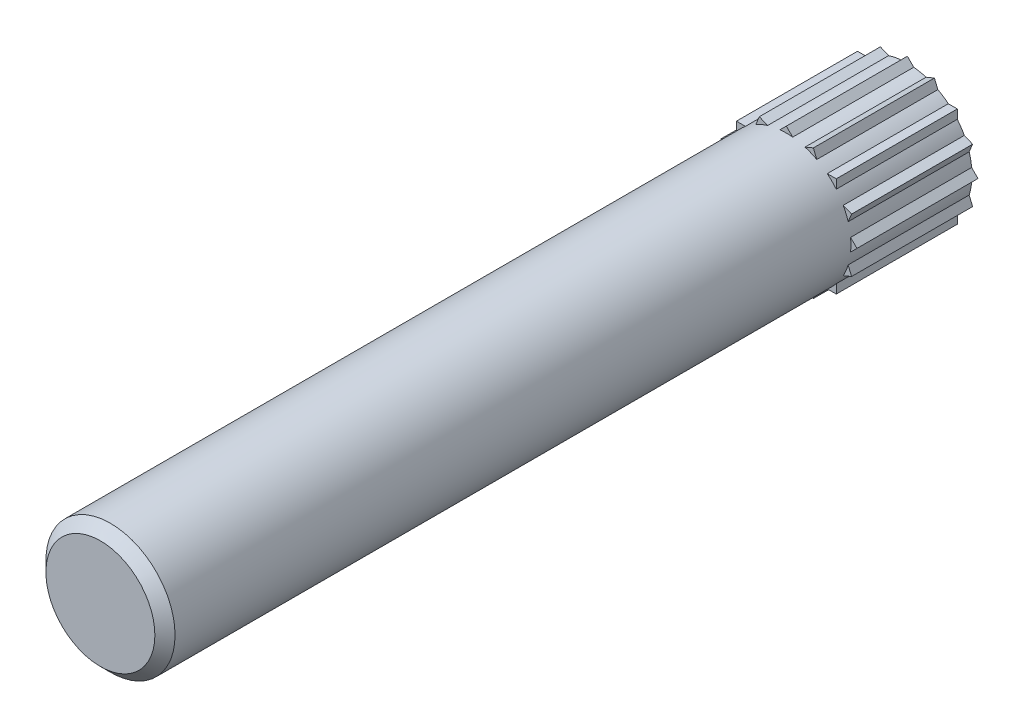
from build123d import *

# Parameters (mm, degrees)
ESQUISSE1_R                  = 1.6
BOSS_EXTRU_1_DEPTH           = 20
CHANFREIN1_SIZE              = 0.25
BOSS_EXTRU_2_DEPTH           = 3
R_P_TITION_CIRCULAIRE1_COUNT = 16


with BuildPart() as part:
    # Esquisse1 → Boss.-Extru.1 (new body)
    with BuildSketch(Plane.XY):
        Circle(ESQUISSE1_R)
    extrude(amount=BOSS_EXTRU_1_DEPTH)

    # Chanfrein1
    chanfrein1_edges = [part.edges().sort_by_distance(p)[0] for p in [
        (-1.6, 0, 20),
    ]]
    chamfer(chanfrein1_edges, length=CHANFREIN1_SIZE)


with BuildPart() as body_2:
    # Esquisse2 → Boss.-Extru.2 (new body)
    with BuildSketch(Plane(origin=(0, 0, 0), x_dir=(-1, 0, 0), z_dir=(0, 0, -1))):
        with BuildLine():
            Line((1.75, 0), (1.592199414, 0.157800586))
            ThreePointArc((1.592199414, 0.157800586), (1.6, 0), (1.592199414, -0.157800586))
            Line((1.592199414, -0.157800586), (1.75, 0))
        make_face()
    boss_extru_2 = extrude(amount=-BOSS_EXTRU_2_DEPTH)


with BuildPart() as part_1:
    add(part.part)

    # R_p_tition circulaire1: Boss.-Extru.2 ×16 about axis
    r_p_tition_circulaire1_axis = Axis((0, 0, 0), (0, 0, 1))
    for i in range(1, R_P_TITION_CIRCULAIRE1_COUNT):
        add(boss_extru_2.rotate(r_p_tition_circulaire1_axis, i * 360 / R_P_TITION_CIRCULAIRE1_COUNT))


solid = Compound([body_2.part, part_1.part])
